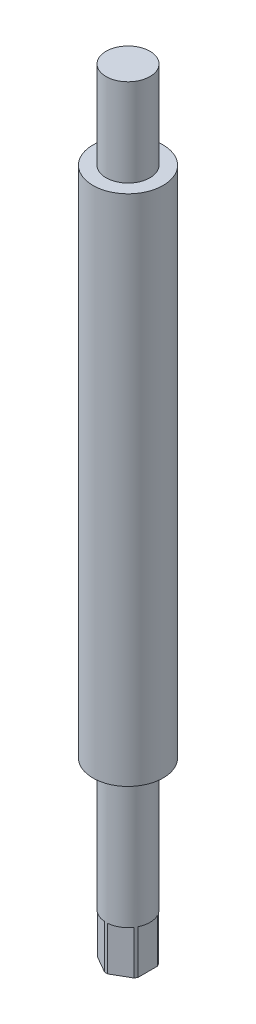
from build123d import *

# Parameters (mm, degrees)
ESQUISSE2_OUTSIDE_W     = 53.688
ESQUISSE2_OUTSIDE_H     = 53.688
ENL_V_MAT_EXTRU_1_DEPTH = 10


with BuildPart() as part:
    # Esquisse1 → R_volution1 (revolve)
    with BuildSketch(Plane(origin=(0, 0, 0), x_dir=(0, 0, -1), z_dir=(1, 0, 0)), mode=Mode.PRIVATE) as r_volution1_sk:
        Polygon((0, 0), (-5, 0), (-5, 40), (-8, 40), (-8, 157), (-5, 157), (-5, 177), (0, 177), align=None)
    revolve(r_volution1_sk.sketch.rotate(Axis((0, -17.539894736, 0), (0, 1, 0)), 180), axis=Axis((0, -17.539894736, 0), (0, 1, 0)))

    # Esquisse2 outside → Enl_v. mat.-Extru.1 (cut)
    with BuildSketch(Plane.XZ):
        Rectangle(ESQUISSE2_OUTSIDE_W, ESQUISSE2_OUTSIDE_H)
        Polygon((0, 5.196152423), (-4.5, 2.598076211), (-4.5, -2.598076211), (0, -5.196152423), (4.5, -2.598076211), (4.5, 2.598076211), align=None, mode=Mode.SUBTRACT)
    extrude(amount=-ENL_V_MAT_EXTRU_1_DEPTH, mode=Mode.SUBTRACT)


solid = part.part
